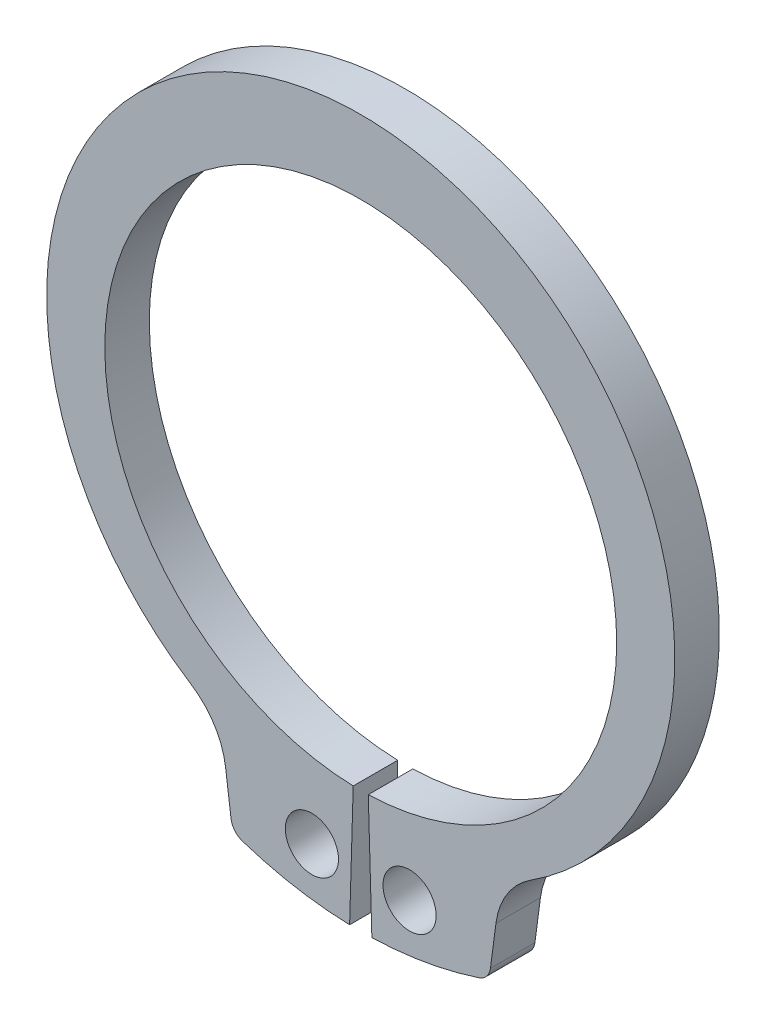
ISO-10303-21;
HEADER;
FILE_DESCRIPTION(('STEP AP214'),'2;1');
FILE_NAME('part.step','',(''),(''),'','','');
FILE_SCHEMA(('AUTOMOTIVE_DESIGN { 1 0 10303 214 1 1 1 1 }'));
ENDSEC;
DATA;
#1=APPLICATION_CONTEXT('core data for automotive mechanical design processes');
#2=APPLICATION_PROTOCOL_DEFINITION('international standard','automotive_design',2000,#1);
#3=PRODUCT_CONTEXT('',#1,'mechanical');
#4=PRODUCT('Part','Part','',(#3));
#5=PRODUCT_RELATED_PRODUCT_CATEGORY('part','',(#4));
#6=PRODUCT_DEFINITION_FORMATION('','',#4);
#7=PRODUCT_DEFINITION_CONTEXT('part definition',#1,'design');
#8=PRODUCT_DEFINITION('design','',#6,#7);
#9=PRODUCT_DEFINITION_SHAPE('','',#8);
#10=(LENGTH_UNIT() NAMED_UNIT(*) SI_UNIT(.MILLI.,.METRE.));
#11=(NAMED_UNIT(*) PLANE_ANGLE_UNIT() SI_UNIT($,.RADIAN.));
#12=(NAMED_UNIT(*) SI_UNIT($,.STERADIAN.) SOLID_ANGLE_UNIT());
#13=UNCERTAINTY_MEASURE_WITH_UNIT(LENGTH_MEASURE(1.E-05),#10,'distance_accuracy_value','');
#14=(GEOMETRIC_REPRESENTATION_CONTEXT(3) GLOBAL_UNCERTAINTY_ASSIGNED_CONTEXT((#13)) GLOBAL_UNIT_ASSIGNED_CONTEXT((#10,
#11,#12)) REPRESENTATION_CONTEXT('',''));
#15=CARTESIAN_POINT('',(0.,0.,0.));
#16=DIRECTION('',(0.,0.,1.));
#17=DIRECTION('',(1.,0.,0.));
#18=AXIS2_PLACEMENT_3D('',#15,#16,#17);
#19=CARTESIAN_POINT('',(0.,0.,-1.));
#20=DIRECTION('',(0.,0.,1.));
#21=DIRECTION('',(1.,0.,0.));
#22=AXIS2_PLACEMENT_3D('',#19,#20,#21);
#23=CYLINDRICAL_SURFACE('',#22,5.75);
#24=CARTESIAN_POINT('',(0.,0.,0.));
#25=DIRECTION('',(0.,0.,-1.));
#26=DIRECTION('',(1.,0.,0.));
#27=AXIS2_PLACEMENT_3D('',#24,#25,#26);
#28=CIRCLE('',#27,5.75);
#29=CARTESIAN_POINT('',(-0.169253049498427,-5.74750845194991,0.));
#30=VERTEX_POINT('',#29);
#31=CARTESIAN_POINT('',(0.169253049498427,-5.74750845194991,0.));
#32=VERTEX_POINT('',#31);
#33=EDGE_CURVE('E119',#30,#32,#28,.T.);
#34=ORIENTED_EDGE('',*,*,#33,.F.);
#35=DIRECTION('',(0.,0.,1.));
#36=VECTOR('',#35,1.);
#37=CARTESIAN_POINT('',(-0.169253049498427,-5.74750845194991,-1.));
#38=LINE('',#37,#36);
#39=CARTESIAN_POINT('',(-0.169253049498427,-5.74750845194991,-1.));
#40=VERTEX_POINT('',#39);
#41=EDGE_CURVE('E11',#40,#30,#38,.T.);
#42=ORIENTED_EDGE('',*,*,#41,.F.);
#43=CARTESIAN_POINT('',(0.,0.,-1.));
#44=DIRECTION('',(0.,0.,-1.));
#45=DIRECTION('',(1.,0.,0.));
#46=AXIS2_PLACEMENT_3D('',#43,#44,#45);
#47=CIRCLE('',#46,5.75);
#48=CARTESIAN_POINT('',(0.169253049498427,-5.74750845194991,-1.));
#49=VERTEX_POINT('',#48);
#50=EDGE_CURVE('E121',#40,#49,#47,.T.);
#51=ORIENTED_EDGE('',*,*,#50,.T.);
#52=DIRECTION('',(0.,0.,1.));
#53=VECTOR('',#52,1.);
#54=CARTESIAN_POINT('',(0.169253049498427,-5.74750845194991,-1.));
#55=LINE('',#54,#53);
#56=EDGE_CURVE('E34',#49,#32,#55,.T.);
#57=ORIENTED_EDGE('',*,*,#56,.T.);
#58=EDGE_LOOP('',(#34,#42,#51,#57));
#59=FACE_BOUND('',#58,.T.);
#60=ADVANCED_FACE('F31',(#59),#23,.F.);
#61=CARTESIAN_POINT('',(-0.169253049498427,-5.74750845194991,-1.));
#62=DIRECTION('',(0.999566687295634,-0.0294353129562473,0.));
#63=DIRECTION('',(0.0294353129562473,0.999566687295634,0.));
#64=AXIS2_PLACEMENT_3D('',#61,#62,#63);
#65=PLANE('',#64);
#66=DIRECTION('',(0.0294353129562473,0.999566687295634,0.));
#67=VECTOR('',#66,1.);
#68=CARTESIAN_POINT('',(-0.169253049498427,-5.74750845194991,0.));
#69=LINE('',#68,#67);
#70=CARTESIAN_POINT('',(-0.25,-8.48951978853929,0.));
#71=VERTEX_POINT('',#70);
#72=EDGE_CURVE('E137',#71,#30,#69,.T.);
#73=ORIENTED_EDGE('',*,*,#72,.F.);
#74=DIRECTION('',(0.,0.,1.));
#75=VECTOR('',#74,1.);
#76=CARTESIAN_POINT('',(-0.25,-8.48951978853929,-1.));
#77=LINE('',#76,#75);
#78=CARTESIAN_POINT('',(-0.25,-8.48951978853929,-1.));
#79=VERTEX_POINT('',#78);
#80=EDGE_CURVE('E39',#79,#71,#77,.T.);
#81=ORIENTED_EDGE('',*,*,#80,.F.);
#82=DIRECTION('',(0.0294353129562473,0.999566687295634,0.));
#83=VECTOR('',#82,1.);
#84=CARTESIAN_POINT('',(-0.169253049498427,-5.74750845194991,-1.));
#85=LINE('',#84,#83);
#86=EDGE_CURVE('E126',#79,#40,#85,.T.);
#87=ORIENTED_EDGE('',*,*,#86,.T.);
#88=ORIENTED_EDGE('',*,*,#41,.T.);
#89=EDGE_LOOP('',(#73,#81,#87,#88));
#90=FACE_BOUND('',#89,.T.);
#91=ADVANCED_FACE('F249',(#90),#65,.T.);
#92=CARTESIAN_POINT('',(0.,0.,-1.));
#93=DIRECTION('',(0.,0.,1.));
#94=DIRECTION('',(1.,0.,0.));
#95=AXIS2_PLACEMENT_3D('',#92,#93,#94);
#96=CYLINDRICAL_SURFACE('',#95,8.4932);
#97=CARTESIAN_POINT('',(0.,0.,0.));
#98=DIRECTION('',(0.,0.,1.));
#99=DIRECTION('',(1.,0.,0.));
#100=AXIS2_PLACEMENT_3D('',#97,#98,#99);
#101=CIRCLE('',#100,8.4932);
#102=CARTESIAN_POINT('',(-2.65478761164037,-8.06762350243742,0.));
#103=VERTEX_POINT('',#102);
#104=EDGE_CURVE('E167',#103,#71,#101,.T.);
#105=ORIENTED_EDGE('',*,*,#104,.F.);
#106=DIRECTION('',(0.,0.,1.));
#107=VECTOR('',#106,1.);
#108=CARTESIAN_POINT('',(-2.65478761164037,-8.06762350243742,-1.));
#109=LINE('',#108,#107);
#110=CARTESIAN_POINT('',(-2.65478761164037,-8.06762350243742,-1.));
#111=VERTEX_POINT('',#110);
#112=EDGE_CURVE('E201',#111,#103,#109,.T.);
#113=ORIENTED_EDGE('',*,*,#112,.F.);
#114=CARTESIAN_POINT('',(0.,0.,-1.));
#115=DIRECTION('',(0.,0.,1.));
#116=DIRECTION('',(1.,0.,0.));
#117=AXIS2_PLACEMENT_3D('',#114,#115,#116);
#118=CIRCLE('',#117,8.4932);
#119=EDGE_CURVE('E197',#111,#79,#118,.T.);
#120=ORIENTED_EDGE('',*,*,#119,.T.);
#121=ORIENTED_EDGE('',*,*,#80,.T.);
#122=EDGE_LOOP('',(#105,#113,#120,#121));
#123=FACE_BOUND('',#122,.T.);
#124=ADVANCED_FACE('F254',(#123),#96,.T.);
#125=CARTESIAN_POINT('',(-2.53569538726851,-7.70571461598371,-1.));
#126=DIRECTION('',(0.,0.,1.));
#127=DIRECTION('',(1.,0.,0.));
#128=AXIS2_PLACEMENT_3D('',#125,#126,#127);
#129=CYLINDRICAL_SURFACE('',#128,0.381000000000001);
#130=CARTESIAN_POINT('',(-2.53569538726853,-7.70571461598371,0.));
#131=DIRECTION('',(0.,0.,1.));
#132=DIRECTION('',(1.,0.,0.));
#133=AXIS2_PLACEMENT_3D('',#130,#131,#132);
#134=CIRCLE('',#133,0.381000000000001);
#135=CARTESIAN_POINT('',(-2.91343587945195,-7.75544509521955,0.));
#136=VERTEX_POINT('',#135);
#137=EDGE_CURVE('E164',#136,#103,#134,.T.);
#138=ORIENTED_EDGE('',*,*,#137,.F.);
#139=DIRECTION('',(0.,0.,1.));
#140=VECTOR('',#139,1.);
#141=CARTESIAN_POINT('',(-2.91343587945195,-7.75544509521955,-1.));
#142=LINE('',#141,#140);
#143=CARTESIAN_POINT('',(-2.91343587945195,-7.75544509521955,-1.));
#144=VERTEX_POINT('',#143);
#145=EDGE_CURVE('E203',#144,#136,#142,.T.);
#146=ORIENTED_EDGE('',*,*,#145,.F.);
#147=CARTESIAN_POINT('',(-2.53569538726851,-7.70571461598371,-1.));
#148=DIRECTION('',(0.,0.,1.));
#149=DIRECTION('',(1.,0.,0.));
#150=AXIS2_PLACEMENT_3D('',#147,#148,#149);
#151=CIRCLE('',#150,0.381000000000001);
#152=EDGE_CURVE('E194',#144,#111,#151,.T.);
#153=ORIENTED_EDGE('',*,*,#152,.T.);
#154=ORIENTED_EDGE('',*,*,#112,.T.);
#155=EDGE_LOOP('',(#138,#146,#153,#154));
#156=FACE_BOUND('',#155,.T.);
#157=ADVANCED_FACE('F246',(#156),#129,.T.);
#158=CARTESIAN_POINT('',(-3.03711374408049,-6.81601844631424,-1.));
#159=DIRECTION('',(-0.991444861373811,-0.13052619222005,0.));
#160=DIRECTION('',(0.13052619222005,-0.991444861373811,0.));
#161=AXIS2_PLACEMENT_3D('',#158,#159,#160);
#162=PLANE('',#161);
#163=DIRECTION('',(0.13052619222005,-0.991444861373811,0.));
#164=VECTOR('',#163,1.);
#165=CARTESIAN_POINT('',(-3.03711374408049,-6.81601844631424,0.));
#166=LINE('',#165,#164);
#167=CARTESIAN_POINT('',(-3.03711374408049,-6.81601844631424,0.));
#168=VERTEX_POINT('',#167);
#169=EDGE_CURVE('E161',#168,#136,#166,.T.);
#170=ORIENTED_EDGE('',*,*,#169,.F.);
#171=DIRECTION('',(0.,0.,1.));
#172=VECTOR('',#171,1.);
#173=CARTESIAN_POINT('',(-3.03711374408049,-6.81601844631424,-1.));
#174=LINE('',#173,#172);
#175=CARTESIAN_POINT('',(-3.03711374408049,-6.81601844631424,-1.));
#176=VERTEX_POINT('',#175);
#177=EDGE_CURVE('E205',#176,#168,#174,.T.);
#178=ORIENTED_EDGE('',*,*,#177,.F.);
#179=DIRECTION('',(0.13052619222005,-0.991444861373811,0.));
#180=VECTOR('',#179,1.);
#181=CARTESIAN_POINT('',(-3.03711374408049,-6.81601844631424,-1.));
#182=LINE('',#181,#180);
#183=EDGE_CURVE('E191',#176,#144,#182,.T.);
#184=ORIENTED_EDGE('',*,*,#183,.T.);
#185=ORIENTED_EDGE('',*,*,#145,.T.);
#186=EDGE_LOOP('',(#170,#178,#184,#185));
#187=FACE_BOUND('',#186,.T.);
#188=ADVANCED_FACE('F242',(#187),#162,.T.);
#189=CARTESIAN_POINT('',(-4.74902080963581,-7.0413952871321,-0.999999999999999));
#190=DIRECTION('',(0.,0.,1.));
#191=DIRECTION('',(1.,0.,0.));
#192=AXIS2_PLACEMENT_3D('',#189,#190,#191);
#193=CYLINDRICAL_SURFACE('',#192,1.72667904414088);
#194=CARTESIAN_POINT('',(-4.74902080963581,-7.0413952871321,0.));
#195=DIRECTION('',(0.,0.,-1.));
#196=DIRECTION('',(1.,0.,0.));
#197=AXIS2_PLACEMENT_3D('',#194,#195,#196);
#198=CIRCLE('',#197,1.72667904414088);
#199=CARTESIAN_POINT('',(-3.81528398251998,-5.58896420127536,0.));
#200=VERTEX_POINT('',#199);
#201=EDGE_CURVE('E158',#200,#168,#198,.T.);
#202=ORIENTED_EDGE('',*,*,#201,.F.);
#203=DIRECTION('',(0.,0.,1.));
#204=VECTOR('',#203,1.);
#205=CARTESIAN_POINT('',(-3.81528398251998,-5.58896420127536,-1.));
#206=LINE('',#205,#204);
#207=CARTESIAN_POINT('',(-3.81528398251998,-5.58896420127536,-1.));
#208=VERTEX_POINT('',#207);
#209=EDGE_CURVE('E207',#208,#200,#206,.T.);
#210=ORIENTED_EDGE('',*,*,#209,.F.);
#211=CARTESIAN_POINT('',(-4.74902080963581,-7.0413952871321,-0.999999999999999));
#212=DIRECTION('',(0.,0.,-1.));
#213=DIRECTION('',(1.,0.,0.));
#214=AXIS2_PLACEMENT_3D('',#211,#212,#213);
#215=CIRCLE('',#214,1.72667904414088);
#216=EDGE_CURVE('E188',#208,#176,#215,.T.);
#217=ORIENTED_EDGE('',*,*,#216,.T.);
#218=ORIENTED_EDGE('',*,*,#177,.T.);
#219=EDGE_LOOP('',(#202,#210,#217,#218));
#220=FACE_BOUND('',#219,.T.);
#221=ADVANCED_FACE('F238',(#220),#193,.F.);
#222=CARTESIAN_POINT('',(0.,0.345724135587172,-1.));
#223=DIRECTION('',(0.,0.,1.));
#224=DIRECTION('',(1.,0.,0.));
#225=AXIS2_PLACEMENT_3D('',#222,#223,#224);
#226=CYLINDRICAL_SURFACE('',#225,7.05527586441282);
#227=CARTESIAN_POINT('',(0.,0.345724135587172,0.));
#228=DIRECTION('',(0.,0.,1.));
#229=DIRECTION('',(1.,0.,0.));
#230=AXIS2_PLACEMENT_3D('',#227,#228,#229);
#231=CIRCLE('',#230,7.05527586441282);
#232=CARTESIAN_POINT('',(3.81528398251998,-5.58896420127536,0.));
#233=VERTEX_POINT('',#232);
#234=EDGE_CURVE('E155',#233,#200,#231,.T.);
#235=ORIENTED_EDGE('',*,*,#234,.F.);
#236=DIRECTION('',(0.,0.,1.));
#237=VECTOR('',#236,1.);
#238=CARTESIAN_POINT('',(3.81528398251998,-5.58896420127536,-1.));
#239=LINE('',#238,#237);
#240=CARTESIAN_POINT('',(3.81528398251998,-5.58896420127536,-1.));
#241=VERTEX_POINT('',#240);
#242=EDGE_CURVE('E209',#241,#233,#239,.T.);
#243=ORIENTED_EDGE('',*,*,#242,.F.);
#244=CARTESIAN_POINT('',(0.,0.345724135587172,-1.));
#245=DIRECTION('',(0.,0.,1.));
#246=DIRECTION('',(1.,0.,0.));
#247=AXIS2_PLACEMENT_3D('',#244,#245,#246);
#248=CIRCLE('',#247,7.05527586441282);
#249=EDGE_CURVE('E185',#241,#208,#248,.T.);
#250=ORIENTED_EDGE('',*,*,#249,.T.);
#251=ORIENTED_EDGE('',*,*,#209,.T.);
#252=EDGE_LOOP('',(#235,#243,#250,#251));
#253=FACE_BOUND('',#252,.T.);
#254=ADVANCED_FACE('F234',(#253),#226,.T.);
#255=CARTESIAN_POINT('',(4.74902080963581,-7.0413952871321,-1.));
#256=DIRECTION('',(0.,0.,1.));
#257=DIRECTION('',(1.,0.,0.));
#258=AXIS2_PLACEMENT_3D('',#255,#256,#257);
#259=CYLINDRICAL_SURFACE('',#258,1.72667904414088);
#260=CARTESIAN_POINT('',(4.74902080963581,-7.0413952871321,0.));
#261=DIRECTION('',(0.,0.,-1.));
#262=DIRECTION('',(1.,0.,0.));
#263=AXIS2_PLACEMENT_3D('',#260,#261,#262);
#264=CIRCLE('',#263,1.72667904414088);
#265=CARTESIAN_POINT('',(3.03711374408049,-6.81601844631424,0.));
#266=VERTEX_POINT('',#265);
#267=EDGE_CURVE('E152',#266,#233,#264,.T.);
#268=ORIENTED_EDGE('',*,*,#267,.F.);
#269=DIRECTION('',(0.,0.,1.));
#270=VECTOR('',#269,1.);
#271=CARTESIAN_POINT('',(3.03711374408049,-6.81601844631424,-1.));
#272=LINE('',#271,#270);
#273=CARTESIAN_POINT('',(3.03711374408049,-6.81601844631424,-1.));
#274=VERTEX_POINT('',#273);
#275=EDGE_CURVE('E211',#274,#266,#272,.T.);
#276=ORIENTED_EDGE('',*,*,#275,.F.);
#277=CARTESIAN_POINT('',(4.74902080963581,-7.0413952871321,-1.));
#278=DIRECTION('',(0.,0.,-1.));
#279=DIRECTION('',(1.,0.,0.));
#280=AXIS2_PLACEMENT_3D('',#277,#278,#279);
#281=CIRCLE('',#280,1.72667904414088);
#282=EDGE_CURVE('E182',#274,#241,#281,.T.);
#283=ORIENTED_EDGE('',*,*,#282,.T.);
#284=ORIENTED_EDGE('',*,*,#242,.T.);
#285=EDGE_LOOP('',(#268,#276,#283,#284));
#286=FACE_BOUND('',#285,.T.);
#287=ADVANCED_FACE('F230',(#286),#259,.F.);
#288=CARTESIAN_POINT('',(3.03711374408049,-6.81601844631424,-1.));
#289=DIRECTION('',(0.991444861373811,-0.13052619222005,0.));
#290=DIRECTION('',(0.13052619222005,0.991444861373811,0.));
#291=AXIS2_PLACEMENT_3D('',#288,#289,#290);
#292=PLANE('',#291);
#293=DIRECTION('',(0.13052619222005,0.991444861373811,0.));
#294=VECTOR('',#293,1.);
#295=CARTESIAN_POINT('',(3.03711374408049,-6.81601844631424,0.));
#296=LINE('',#295,#294);
#297=CARTESIAN_POINT('',(2.91343587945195,-7.75544509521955,0.));
#298=VERTEX_POINT('',#297);
#299=EDGE_CURVE('E149',#298,#266,#296,.T.);
#300=ORIENTED_EDGE('',*,*,#299,.F.);
#301=DIRECTION('',(0.,0.,1.));
#302=VECTOR('',#301,1.);
#303=CARTESIAN_POINT('',(2.91343587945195,-7.75544509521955,-1.));
#304=LINE('',#303,#302);
#305=CARTESIAN_POINT('',(2.91343587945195,-7.75544509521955,-1.));
#306=VERTEX_POINT('',#305);
#307=EDGE_CURVE('E213',#306,#298,#304,.T.);
#308=ORIENTED_EDGE('',*,*,#307,.F.);
#309=DIRECTION('',(0.13052619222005,0.991444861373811,0.));
#310=VECTOR('',#309,1.);
#311=CARTESIAN_POINT('',(3.03711374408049,-6.81601844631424,-1.));
#312=LINE('',#311,#310);
#313=EDGE_CURVE('E179',#306,#274,#312,.T.);
#314=ORIENTED_EDGE('',*,*,#313,.T.);
#315=ORIENTED_EDGE('',*,*,#275,.T.);
#316=EDGE_LOOP('',(#300,#308,#314,#315));
#317=FACE_BOUND('',#316,.T.);
#318=ADVANCED_FACE('F226',(#317),#292,.T.);
#319=CARTESIAN_POINT('',(2.53569538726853,-7.70571461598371,-0.999999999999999));
#320=DIRECTION('',(0.,0.,1.));
#321=DIRECTION('',(1.,0.,0.));
#322=AXIS2_PLACEMENT_3D('',#319,#320,#321);
#323=CYLINDRICAL_SURFACE('',#322,0.381000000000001);
#324=CARTESIAN_POINT('',(2.53569538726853,-7.70571461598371,0.));
#325=DIRECTION('',(0.,0.,1.));
#326=DIRECTION('',(-1.,0.,0.));
#327=AXIS2_PLACEMENT_3D('',#324,#325,#326);
#328=CIRCLE('',#327,0.381000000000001);
#329=CARTESIAN_POINT('',(2.65478761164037,-8.06762350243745,0.));
#330=VERTEX_POINT('',#329);
#331=EDGE_CURVE('E146',#330,#298,#328,.T.);
#332=ORIENTED_EDGE('',*,*,#331,.F.);
#333=DIRECTION('',(0.,0.,1.));
#334=VECTOR('',#333,1.);
#335=CARTESIAN_POINT('',(2.65478761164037,-8.06762350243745,-1.));
#336=LINE('',#335,#334);
#337=CARTESIAN_POINT('',(2.65478761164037,-8.06762350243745,-1.));
#338=VERTEX_POINT('',#337);
#339=EDGE_CURVE('E215',#338,#330,#336,.T.);
#340=ORIENTED_EDGE('',*,*,#339,.F.);
#341=CARTESIAN_POINT('',(2.53569538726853,-7.70571461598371,-0.999999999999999));
#342=DIRECTION('',(0.,0.,1.));
#343=DIRECTION('',(-1.,0.,0.));
#344=AXIS2_PLACEMENT_3D('',#341,#342,#343);
#345=CIRCLE('',#344,0.381000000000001);
#346=EDGE_CURVE('E176',#338,#306,#345,.T.);
#347=ORIENTED_EDGE('',*,*,#346,.T.);
#348=ORIENTED_EDGE('',*,*,#307,.T.);
#349=EDGE_LOOP('',(#332,#340,#347,#348));
#350=FACE_BOUND('',#349,.T.);
#351=ADVANCED_FACE('F222',(#350),#323,.T.);
#352=CARTESIAN_POINT('',(0.,0.,-1.));
#353=DIRECTION('',(0.,0.,1.));
#354=DIRECTION('',(1.,0.,0.));
#355=AXIS2_PLACEMENT_3D('',#352,#353,#354);
#356=CYLINDRICAL_SURFACE('',#355,8.4932);
#357=CARTESIAN_POINT('',(0.,0.,0.));
#358=DIRECTION('',(0.,0.,1.));
#359=DIRECTION('',(1.,0.,0.));
#360=AXIS2_PLACEMENT_3D('',#357,#358,#359);
#361=CIRCLE('',#360,8.4932);
#362=CARTESIAN_POINT('',(0.25,-8.48951978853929,0.));
#363=VERTEX_POINT('',#362);
#364=EDGE_CURVE('E133',#363,#330,#361,.T.);
#365=ORIENTED_EDGE('',*,*,#364,.F.);
#366=DIRECTION('',(0.,0.,1.));
#367=VECTOR('',#366,1.);
#368=CARTESIAN_POINT('',(0.25,-8.48951978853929,-1.));
#369=LINE('',#368,#367);
#370=CARTESIAN_POINT('',(0.25,-8.48951978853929,-1.));
#371=VERTEX_POINT('',#370);
#372=EDGE_CURVE('E125',#371,#363,#369,.T.);
#373=ORIENTED_EDGE('',*,*,#372,.F.);
#374=CARTESIAN_POINT('',(0.,0.,-1.));
#375=DIRECTION('',(0.,0.,1.));
#376=DIRECTION('',(1.,0.,0.));
#377=AXIS2_PLACEMENT_3D('',#374,#375,#376);
#378=CIRCLE('',#377,8.4932);
#379=EDGE_CURVE('E173',#371,#338,#378,.T.);
#380=ORIENTED_EDGE('',*,*,#379,.T.);
#381=ORIENTED_EDGE('',*,*,#339,.T.);
#382=EDGE_LOOP('',(#365,#373,#380,#381));
#383=FACE_BOUND('',#382,.T.);
#384=ADVANCED_FACE('F218',(#383),#356,.T.);
#385=CARTESIAN_POINT('',(0.169253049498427,-5.74750845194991,-1.));
#386=DIRECTION('',(-0.999566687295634,-0.0294353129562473,0.));
#387=DIRECTION('',(0.0294353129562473,-0.999566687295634,0.));
#388=AXIS2_PLACEMENT_3D('',#385,#386,#387);
#389=PLANE('',#388);
#390=DIRECTION('',(0.0294353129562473,-0.999566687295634,0.));
#391=VECTOR('',#390,1.);
#392=CARTESIAN_POINT('',(0.169253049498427,-5.74750845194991,0.));
#393=LINE('',#392,#391);
#394=EDGE_CURVE('E128',#32,#363,#393,.T.);
#395=ORIENTED_EDGE('',*,*,#394,.F.);
#396=ORIENTED_EDGE('',*,*,#56,.F.);
#397=DIRECTION('',(0.0294353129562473,-0.999566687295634,0.));
#398=VECTOR('',#397,1.);
#399=CARTESIAN_POINT('',(0.169253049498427,-5.74750845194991,-1.));
#400=LINE('',#399,#398);
#401=EDGE_CURVE('E171',#49,#371,#400,.T.);
#402=ORIENTED_EDGE('',*,*,#401,.T.);
#403=ORIENTED_EDGE('',*,*,#372,.T.);
#404=EDGE_LOOP('',(#395,#396,#402,#403));
#405=FACE_BOUND('',#404,.T.);
#406=ADVANCED_FACE('F129',(#405),#389,.T.);
#407=CARTESIAN_POINT('',(0.,0.,-1.));
#408=DIRECTION('',(0.,0.,1.));
#409=DIRECTION('',(1.,0.,0.));
#410=AXIS2_PLACEMENT_3D('',#407,#408,#409);
#411=PLANE('',#410);
#412=CARTESIAN_POINT('',(-1.0969,-7.34009243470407,-0.999999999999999));
#413=DIRECTION('',(0.,0.,1.));
#414=DIRECTION('',(1.,0.,0.));
#415=AXIS2_PLACEMENT_3D('',#412,#413,#414);
#416=CIRCLE('',#415,0.5969);
#417=CARTESIAN_POINT('',(-0.499999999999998,-7.34009243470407,-0.999999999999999));
#418=VERTEX_POINT('',#417);
#419=EDGE_CURVE('E388',#418,#418,#416,.T.);
#420=ORIENTED_EDGE('',*,*,#419,.T.);
#421=EDGE_LOOP('',(#420));
#422=FACE_BOUND('',#421,.T.);
#423=CARTESIAN_POINT('',(1.0969,-7.34009243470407,-1.));
#424=DIRECTION('',(0.,0.,1.));
#425=DIRECTION('',(1.,0.,0.));
#426=AXIS2_PLACEMENT_3D('',#423,#424,#425);
#427=CIRCLE('',#426,0.5969);
#428=CARTESIAN_POINT('',(1.6938,-7.34009243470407,-1.));
#429=VERTEX_POINT('',#428);
#430=EDGE_CURVE('E138',#429,#429,#427,.T.);
#431=ORIENTED_EDGE('',*,*,#430,.T.);
#432=EDGE_LOOP('',(#431));
#433=FACE_BOUND('',#432,.T.);
#434=ORIENTED_EDGE('',*,*,#50,.F.);
#435=ORIENTED_EDGE('',*,*,#86,.F.);
#436=ORIENTED_EDGE('',*,*,#119,.F.);
#437=ORIENTED_EDGE('',*,*,#152,.F.);
#438=ORIENTED_EDGE('',*,*,#183,.F.);
#439=ORIENTED_EDGE('',*,*,#216,.F.);
#440=ORIENTED_EDGE('',*,*,#249,.F.);
#441=ORIENTED_EDGE('',*,*,#282,.F.);
#442=ORIENTED_EDGE('',*,*,#313,.F.);
#443=ORIENTED_EDGE('',*,*,#346,.F.);
#444=ORIENTED_EDGE('',*,*,#379,.F.);
#445=ORIENTED_EDGE('',*,*,#401,.F.);
#446=EDGE_LOOP('',(#434,#435,#436,#437,#438,#439,#440,#441,#442,#443,#444,#445));
#447=FACE_BOUND('',#446,.T.);
#448=ADVANCED_FACE('F253',(#422,#433,#447),#411,.F.);
#449=CARTESIAN_POINT('',(0.,0.,0.));
#450=DIRECTION('',(0.,0.,1.));
#451=DIRECTION('',(1.,0.,0.));
#452=AXIS2_PLACEMENT_3D('',#449,#450,#451);
#453=PLANE('',#452);
#454=CARTESIAN_POINT('',(-1.0969,-7.34009243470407,0.));
#455=DIRECTION('',(0.,0.,1.));
#456=DIRECTION('',(1.,0.,0.));
#457=AXIS2_PLACEMENT_3D('',#454,#455,#456);
#458=CIRCLE('',#457,0.5969);
#459=CARTESIAN_POINT('',(-0.499999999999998,-7.34009243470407,0.));
#460=VERTEX_POINT('',#459);
#461=EDGE_CURVE('E391',#460,#460,#458,.T.);
#462=ORIENTED_EDGE('',*,*,#461,.F.);
#463=EDGE_LOOP('',(#462));
#464=FACE_BOUND('',#463,.T.);
#465=CARTESIAN_POINT('',(1.0969,-7.34009243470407,0.));
#466=DIRECTION('',(0.,0.,1.));
#467=DIRECTION('',(1.,0.,0.));
#468=AXIS2_PLACEMENT_3D('',#465,#466,#467);
#469=CIRCLE('',#468,0.5969);
#470=CARTESIAN_POINT('',(1.6938,-7.34009243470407,0.));
#471=VERTEX_POINT('',#470);
#472=EDGE_CURVE('E141',#471,#471,#469,.T.);
#473=ORIENTED_EDGE('',*,*,#472,.F.);
#474=EDGE_LOOP('',(#473));
#475=FACE_BOUND('',#474,.T.);
#476=ORIENTED_EDGE('',*,*,#33,.T.);
#477=ORIENTED_EDGE('',*,*,#394,.T.);
#478=ORIENTED_EDGE('',*,*,#364,.T.);
#479=ORIENTED_EDGE('',*,*,#331,.T.);
#480=ORIENTED_EDGE('',*,*,#299,.T.);
#481=ORIENTED_EDGE('',*,*,#267,.T.);
#482=ORIENTED_EDGE('',*,*,#234,.T.);
#483=ORIENTED_EDGE('',*,*,#201,.T.);
#484=ORIENTED_EDGE('',*,*,#169,.T.);
#485=ORIENTED_EDGE('',*,*,#137,.T.);
#486=ORIENTED_EDGE('',*,*,#104,.T.);
#487=ORIENTED_EDGE('',*,*,#72,.T.);
#488=EDGE_LOOP('',(#476,#477,#478,#479,#480,#481,#482,#483,#484,#485,#486,#487));
#489=FACE_BOUND('',#488,.T.);
#490=ADVANCED_FACE('F135',(#464,#475,#489),#453,.T.);
#491=CARTESIAN_POINT('',(1.0969,-7.34009243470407,-1.));
#492=DIRECTION('',(0.,0.,1.));
#493=DIRECTION('',(1.,0.,0.));
#494=AXIS2_PLACEMENT_3D('',#491,#492,#493);
#495=CYLINDRICAL_SURFACE('',#494,0.5969);
#496=ORIENTED_EDGE('',*,*,#430,.F.);
#497=EDGE_LOOP('',(#496));
#498=FACE_BOUND('',#497,.T.);
#499=ORIENTED_EDGE('',*,*,#472,.T.);
#500=EDGE_LOOP('',(#499));
#501=FACE_BOUND('',#500,.T.);
#502=ADVANCED_FACE('F361',(#498,#501),#495,.F.);
#503=CARTESIAN_POINT('',(-1.0969,-7.34009243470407,-0.999999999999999));
#504=DIRECTION('',(0.,0.,1.));
#505=DIRECTION('',(1.,0.,0.));
#506=AXIS2_PLACEMENT_3D('',#503,#504,#505);
#507=CYLINDRICAL_SURFACE('',#506,0.5969);
#508=ORIENTED_EDGE('',*,*,#419,.F.);
#509=EDGE_LOOP('',(#508));
#510=FACE_BOUND('',#509,.T.);
#511=ORIENTED_EDGE('',*,*,#461,.T.);
#512=EDGE_LOOP('',(#511));
#513=FACE_BOUND('',#512,.T.);
#514=ADVANCED_FACE('F371',(#510,#513),#507,.F.);
#515=CLOSED_SHELL('',(#60,#91,#124,#157,#188,#221,#254,#287,#318,#351,#384,#406,#448,#490,#502,#514));
#516=MANIFOLD_SOLID_BREP('B2',#515);
#517=ADVANCED_BREP_SHAPE_REPRESENTATION('',(#18,#516),#14);
#518=SHAPE_DEFINITION_REPRESENTATION(#9,#517);
ENDSEC;
END-ISO-10303-21;
